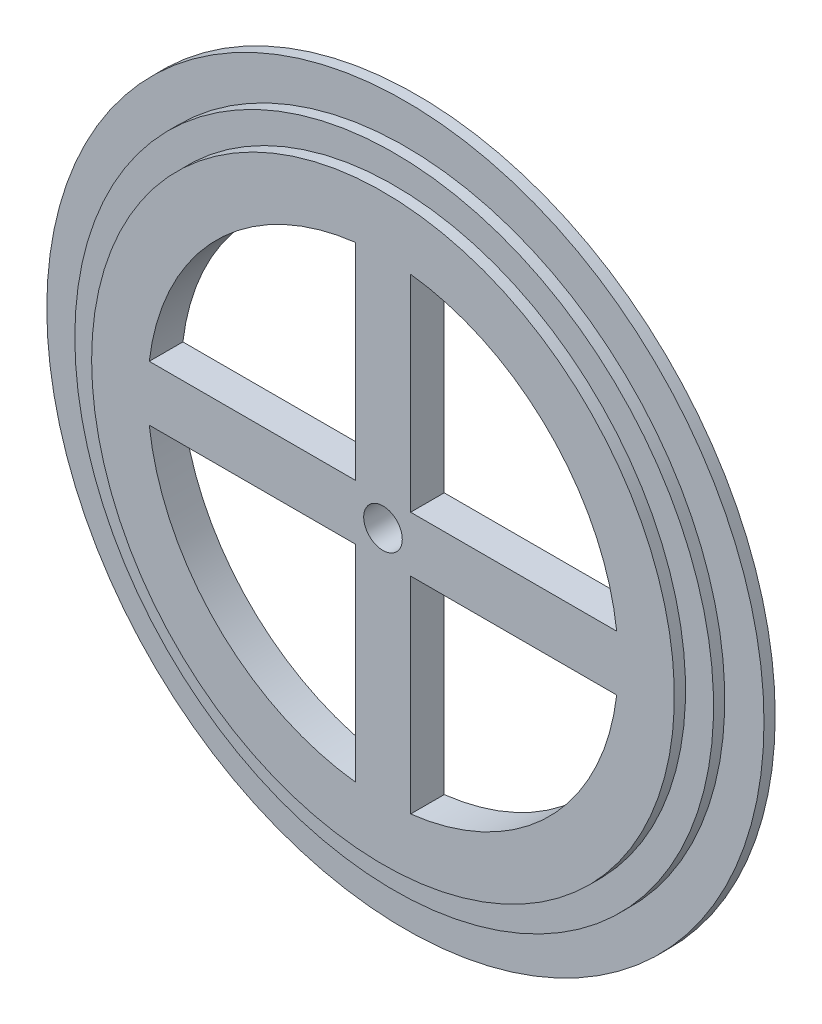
from build123d import *

# Parameters (mm, degrees)
SKETCH2_R          = 5.465702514
CUT_EXTRUDE1_DEPTH = 144.999463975


with BuildPart() as part:
    # Sketch1 → Revolve1 (revolve)
    with BuildSketch(Plane(origin=(0, 0, 0), x_dir=(0, 0, -1), z_dir=(1, 0, 0)), mode=Mode.PRIVATE) as revolve1_sk:
        Polygon((0, 0), (0, 82.55), (3.175, 82.55), (3.175, 90.4875), (6.35, 90.4875), (6.35, 101.6), (9.525, 101.6), (9.525, 0), align=None)
    revolve(revolve1_sk.sketch.rotate(Axis((0, 0, -9.525), (0, 0, 1)), 90), axis=Axis((0, 0, -9.525), (0, 0, 1)))

    # Sketch2 → Cut-Extrude1 (cut, through all)
    with BuildSketch(Plane.XY):
        with BuildLine():
            Line((-7.829863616, 7.829863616), (-7.829863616, 66.213660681))
            ThreePointArc((-7.829863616, 66.213660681), (-47.146344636, 47.146344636), (-66.213660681, 7.829863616))
            Line((-66.213660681, 7.829863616), (-7.829863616, 7.829863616))
        make_face()
        with BuildLine():
            ThreePointArc((66.213660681, 7.829863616), (47.146344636, 47.146344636), (7.829863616, 66.213660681))
            Line((7.829863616, 66.213660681), (7.829863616, 7.829863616))
            Line((7.829863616, 7.829863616), (66.213660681, 7.829863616))
        make_face()
        with BuildLine():
            ThreePointArc((7.829863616, -66.213660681), (47.146344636, -47.146344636), (66.213660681, -7.829863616))
            Line((66.213660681, -7.829863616), (7.829863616, -7.829863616))
            Line((7.829863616, -7.829863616), (7.829863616, -66.213660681))
        make_face()
        with BuildLine():
            Line((-7.829863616, -7.829863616), (-66.213660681, -7.829863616))
            ThreePointArc((-66.213660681, -7.829863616), (-47.146344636, -47.146344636), (-7.829863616, -66.213660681))
            Line((-7.829863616, -66.213660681), (-7.829863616, -7.829863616))
        make_face()
        Circle(SKETCH2_R)
    extrude(amount=-CUT_EXTRUDE1_DEPTH, mode=Mode.SUBTRACT)


solid = part.part
